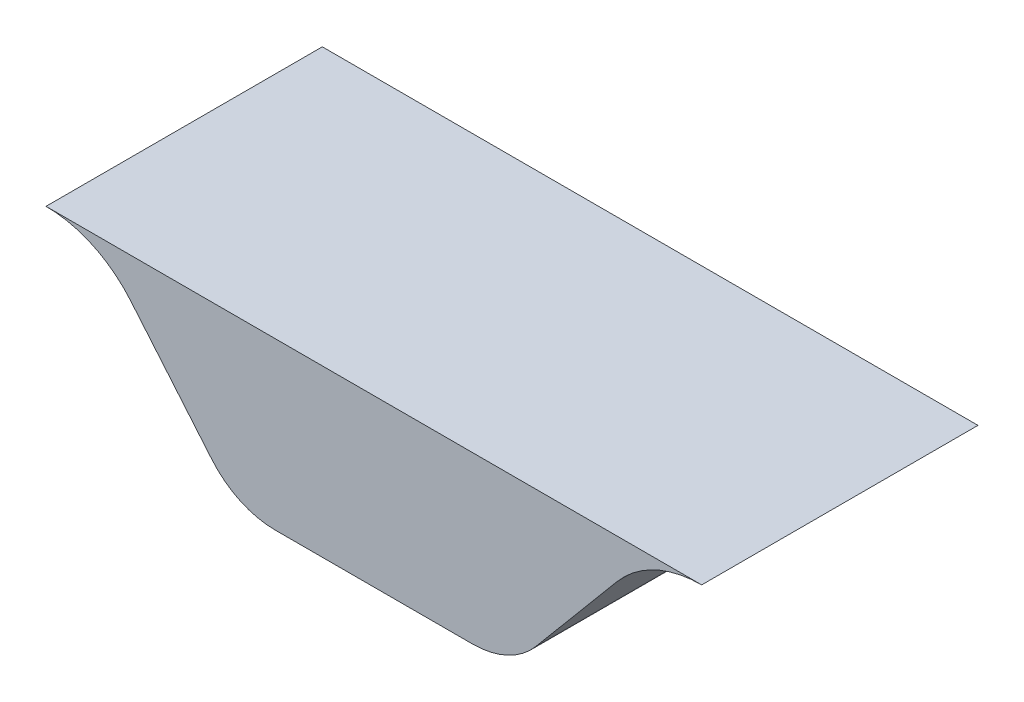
from build123d import *

# Parameters (mm, degrees)
SKETCH1_W           = 50
SKETCH1_H           = 5
BASE_EXTRUDE_DEPTH  = 25
BOSS_EXTRUDE1_DEPTH = 5
FILLET1_R           = 3
FILLET2_R           = 4
SKETCH3_W           = 50
SKETCH3_H           = 5
CUT_EXTRUDE1_DEPTH  = 57.222771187


with BuildPart() as part:
    # Sketch1 → Base-Extrude (new, symmetric)
    with BuildSketch(Plane.XY):
        with Locations((0, 2.5)):
            Rectangle(SKETCH1_W, SKETCH1_H)
    extrude(amount=BASE_EXTRUDE_DEPTH, both=True)

    # Sketch2 → Boss-Extrude1 (add, symmetric)
    with BuildSketch(Plane.XY):
        Polygon((-10, 0), (-4.965402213, -6), (4.965402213, -6), (10, 0), align=None)
    extrude(amount=BOSS_EXTRUDE1_DEPTH, both=True)

    # Fillet1
    fillet1_edges = [part.edges().sort_by_distance(p)[0] for p in [
        (-4.965402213, -6, 0),
        (4.965402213, -6, 0),
    ]]
    fillet(fillet1_edges, radius=FILLET1_R)

    # Fillet2
    fillet2_edges = [part.edges().sort_by_distance(p)[0] for p in [
        (10, 0, 0),
        (-10, 0, 0),
    ]]
    fillet(fillet2_edges, radius=FILLET2_R)

    # Sketch3 → Cut-Extrude1 (cut, through all)
    with BuildSketch(Plane(origin=(25, 0, 0), x_dir=(0, 0, -1), z_dir=(1, 0, 0))):
        with Locations((0, 2.5)):
            Rectangle(SKETCH3_W, SKETCH3_H)
    extrude(amount=-CUT_EXTRUDE1_DEPTH, mode=Mode.SUBTRACT)


solid = part.part
